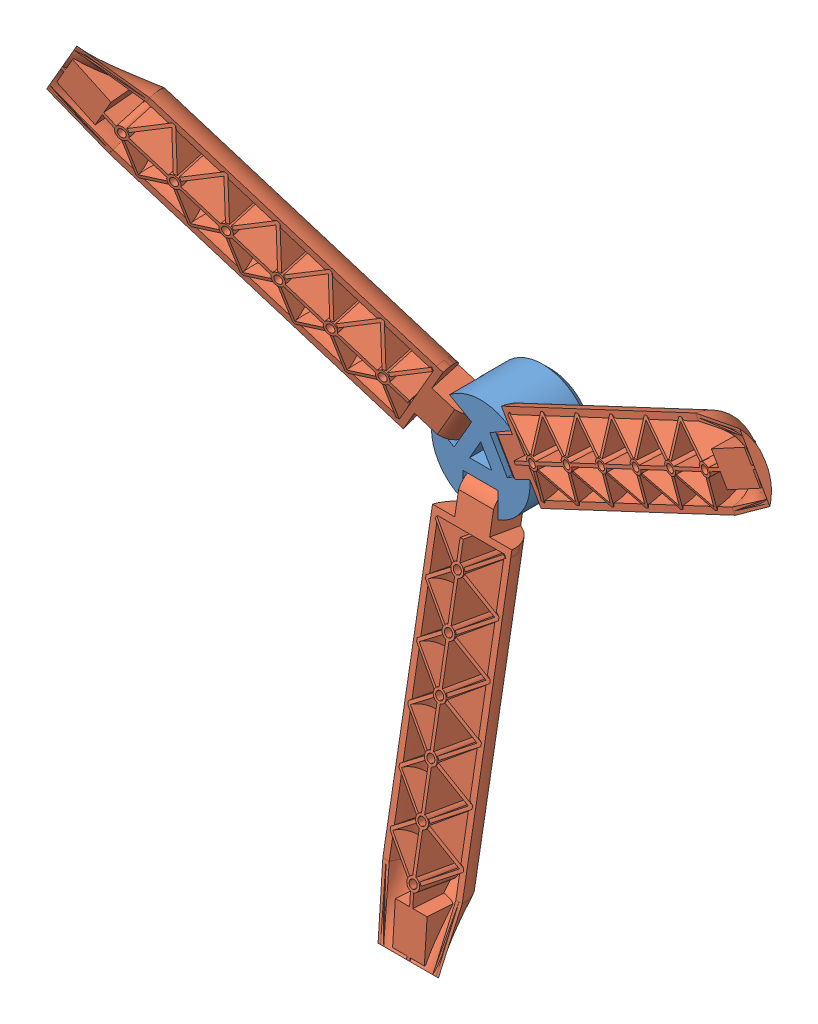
SolidWorks assembly Assemblage trépieds.SLDASM, configuration Défaut (file format 9000). Lengths in mm.
Overall size (247.16 214.04 80.09).
4 component instances, 2 part files, 9 mates.
Components (placement in the parent):
- Douille trépied-1: Douille trépied.SLDPRT [Défaut] at (-0.4718 -0.0786 22.5) size (31 31 27)
- Pied-1: Pied.SLDPRT [Défaut] at (-0.9718 -17.7202 48.2058) x (-1 0 0) z (0 -0.984808 0.173648) size (25.01 59.81 122.02)
- Pied-2: Pied.SLDPRT [Défaut] at (15.0562 8.3091 48.2058) x (0.5 -0.866025 0) z (0.852869 0.492404 0.173648) size (25.01 59.81 122.02)
- Pied-3: Pied.SLDPRT [Défaut] at (-15.4998 9.1751 48.2058) x (0.5 0.866025 0) z (-0.852869 0.492404 0.173648) size (25.01 59.81 122.02)
Mates (geometry in assembly coordinates):
- Coaxiale1: concentric anti-aligned: cylinder of Douille trépied-1 through (5.0282 -13.57 40) axis (-1 0 0) radius 1; cylinder of Pied-1 through (4.0282 -13.57 40) axis (1 0 0) radius 1
- Coïncidente1: coincident anti-aligned: plane of Douille trépied-1 through (5.0282 -6.57 33.5) normal (-1 0 0); plane of Pied-1 through (5.0282 -13.57 40) normal (1 0 0)
- Coaxiale3: concentric anti-aligned: cylinder of Douille trépied-1 through (8.4621 11.4302 40) axis (0.5 -0.866025 0) radius 1; cylinder of Pied-2 through (8.9621 10.5642 40) axis (-0.5 0.866025 0) radius 1
- Coïncidente2: coincident anti-aligned: plane of Douille trépied-1 through (2.3999 7.9302 33.5) normal (0.5 -0.866025 0); plane of Pied-2 through (8.4621 11.4302 40) normal (-0.5 0.866025 0)
- Coaxiale4: concentric anti-aligned: cylinder of Douille trépied-1 through (-14.9057 1.9039 40) axis (0.5 0.866025 0) radius 1; cylinder of Pied-3 through (-14.4057 2.7699 40) axis (-0.5 -0.866025 0) radius 1
- Coïncidente3: coincident anti-aligned: plane of Douille trépied-1 through (-3.3435 7.9302 33.5) normal (-0.5 -0.866025 0); plane of Pied-3 through (-9.4057 11.4302 40) normal (0.5 0.866025 0)
- Angle1: planar angle = 1.396263 rad anti-aligned: axis of Douille trépied-1 through (-0.4718 -0.0786 33.5) axis (0 0 -1); line of Pied-3 through (-17.1617 9.5573 50.4777) axis (-0.852869 0.492404 0.173648)
- Angle2: planar angle = 1.396263 rad anti-aligned: axis of Douille trépied-1 through (-0.4718 -0.0786 33.5) axis (0 0 -1); line of Pied-2 through (16.218 9.5573 50.4777) axis (0.852869 0.492404 0.173648)
- Angle3: planar angle = 1.396263 rad anti-aligned: axis of Douille trépied-1 through (-0.4718 -0.0786 33.5) axis (0 0 -1); line of Pied-1 through (-0.4718 -19.3504 50.4777) axis (0 -0.984808 0.173648)
